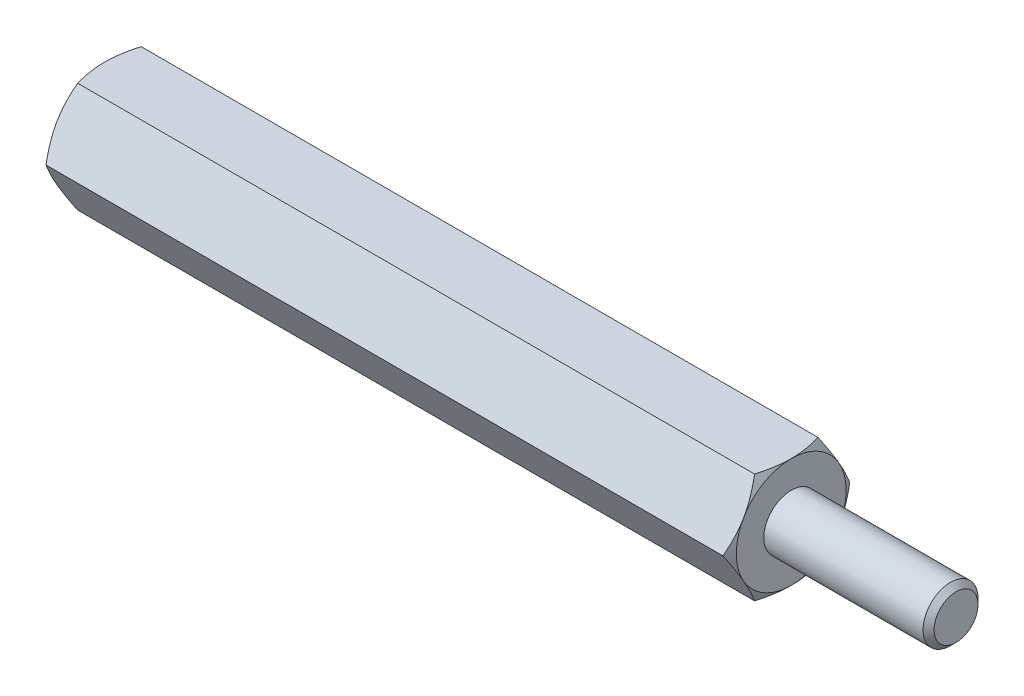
ISO-10303-21;
HEADER;
FILE_DESCRIPTION(('STEP AP214'),'2;1');
FILE_NAME('part.step','',(''),(''),'','','');
FILE_SCHEMA(('AUTOMOTIVE_DESIGN { 1 0 10303 214 1 1 1 1 }'));
ENDSEC;
DATA;
#1=APPLICATION_CONTEXT('core data for automotive mechanical design processes');
#2=APPLICATION_PROTOCOL_DEFINITION('international standard','automotive_design',2000,#1);
#3=PRODUCT_CONTEXT('',#1,'mechanical');
#4=PRODUCT('Part','Part','',(#3));
#5=PRODUCT_RELATED_PRODUCT_CATEGORY('part','',(#4));
#6=PRODUCT_DEFINITION_FORMATION('','',#4);
#7=PRODUCT_DEFINITION_CONTEXT('part definition',#1,'design');
#8=PRODUCT_DEFINITION('design','',#6,#7);
#9=PRODUCT_DEFINITION_SHAPE('','',#8);
#10=(LENGTH_UNIT() NAMED_UNIT(*) SI_UNIT(.MILLI.,.METRE.));
#11=(NAMED_UNIT(*) PLANE_ANGLE_UNIT() SI_UNIT($,.RADIAN.));
#12=(NAMED_UNIT(*) SI_UNIT($,.STERADIAN.) SOLID_ANGLE_UNIT());
#13=UNCERTAINTY_MEASURE_WITH_UNIT(LENGTH_MEASURE(1.E-05),#10,'distance_accuracy_value','');
#14=(GEOMETRIC_REPRESENTATION_CONTEXT(3) GLOBAL_UNCERTAINTY_ASSIGNED_CONTEXT((#13)) GLOBAL_UNIT_ASSIGNED_CONTEXT((#10,
#11,#12)) REPRESENTATION_CONTEXT('',''));
#15=CARTESIAN_POINT('',(0.,0.,0.));
#16=DIRECTION('',(0.,0.,1.));
#17=DIRECTION('',(1.,0.,0.));
#18=AXIS2_PLACEMENT_3D('',#15,#16,#17);
#19=CARTESIAN_POINT('',(12.5,2.,-1.15470053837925));
#20=DIRECTION('',(1.,0.,0.));
#21=DIRECTION('',(0.,0.,-1.));
#22=AXIS2_PLACEMENT_3D('',#19,#20,#21);
#23=PLANE('',#22);
#24=CARTESIAN_POINT('',(12.5,0.,0.));
#25=DIRECTION('',(1.,0.,0.));
#26=DIRECTION('',(0.,0.,-1.));
#27=AXIS2_PLACEMENT_3D('',#24,#25,#26);
#28=CIRCLE('',#27,2.);
#29=CARTESIAN_POINT('',(12.5,-1.,-1.73205080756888));
#30=VERTEX_POINT('',#29);
#31=CARTESIAN_POINT('',(12.5,0.999999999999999,-1.73205080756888));
#32=VERTEX_POINT('',#31);
#33=EDGE_CURVE('E288',#30,#32,#28,.T.);
#34=ORIENTED_EDGE('',*,*,#33,.T.);
#35=CARTESIAN_POINT('',(12.5,2.,0.));
#36=VERTEX_POINT('',#35);
#37=EDGE_CURVE('E53',#32,#36,#28,.T.);
#38=ORIENTED_EDGE('',*,*,#37,.T.);
#39=CARTESIAN_POINT('',(12.5,0.999999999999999,1.73205080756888));
#40=VERTEX_POINT('',#39);
#41=EDGE_CURVE('E297',#36,#40,#28,.T.);
#42=ORIENTED_EDGE('',*,*,#41,.T.);
#43=CARTESIAN_POINT('',(12.5,-1.,1.73205080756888));
#44=VERTEX_POINT('',#43);
#45=EDGE_CURVE('E302',#40,#44,#28,.T.);
#46=ORIENTED_EDGE('',*,*,#45,.T.);
#47=CARTESIAN_POINT('',(12.5,0.,0.));
#48=DIRECTION('',(-1.,0.,0.));
#49=DIRECTION('',(0.,-1.,0.));
#50=AXIS2_PLACEMENT_3D('',#47,#48,#49);
#51=CIRCLE('',#50,2.);
#52=CARTESIAN_POINT('',(12.5,-2.,0.));
#53=VERTEX_POINT('',#52);
#54=EDGE_CURVE('E193',#53,#44,#51,.T.);
#55=ORIENTED_EDGE('',*,*,#54,.F.);
#56=EDGE_CURVE('E61',#53,#30,#28,.T.);
#57=ORIENTED_EDGE('',*,*,#56,.T.);
#58=EDGE_LOOP('',(#34,#38,#42,#46,#55,#57));
#59=FACE_BOUND('',#58,.T.);
#60=CARTESIAN_POINT('',(12.5,0.,0.));
#61=DIRECTION('',(1.,0.,0.));
#62=DIRECTION('',(0.,0.,-1.));
#63=AXIS2_PLACEMENT_3D('',#60,#61,#62);
#64=CIRCLE('',#63,1.);
#65=CARTESIAN_POINT('',(12.5,0.,-1.));
#66=VERTEX_POINT('',#65);
#67=EDGE_CURVE('E323',#66,#66,#64,.T.);
#68=ORIENTED_EDGE('',*,*,#67,.F.);
#69=EDGE_LOOP('',(#68));
#70=FACE_BOUND('',#69,.T.);
#71=ADVANCED_FACE('F37',(#59,#70),#23,.T.);
#72=CARTESIAN_POINT('',(12.5,0.,-2.3094010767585));
#73=DIRECTION('',(0.,-0.5,0.866025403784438));
#74=DIRECTION('',(0.,-0.866025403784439,-0.5));
#75=AXIS2_PLACEMENT_3D('',#72,#73,#74);
#76=PLANE('',#75);
#77=CARTESIAN_POINT('',(12.3213005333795,-0.000200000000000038,-2.30951654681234));
#78=CARTESIAN_POINT('',(12.3506104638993,0.0876912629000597,-2.25877250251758));
#79=CARTESIAN_POINT('',(12.3772671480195,0.176341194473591,-2.20759044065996));
#80=CARTESIAN_POINT('',(12.4237975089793,0.355176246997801,-2.10433997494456));
#81=CARTESIAN_POINT('',(12.4436547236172,0.445364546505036,-2.05226973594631));
#82=CARTESIAN_POINT('',(12.4745665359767,0.624623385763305,-1.94877459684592));
#83=CARTESIAN_POINT('',(12.4858268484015,0.713666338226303,-1.89736562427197));
#84=CARTESIAN_POINT('',(12.4992713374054,0.892171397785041,-1.79430568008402));
#85=CARTESIAN_POINT('',(12.5014666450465,0.981632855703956,-1.74265508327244));
#86=CARTESIAN_POINT('',(12.4969090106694,1.1488083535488,-1.64613626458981));
#87=CARTESIAN_POINT('',(12.491275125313,1.22654737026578,-1.60125362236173));
#88=CARTESIAN_POINT('',(12.4734161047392,1.38151891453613,-1.51178075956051));
#89=CARTESIAN_POINT('',(12.4611848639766,1.4587509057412,-1.46719084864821));
#90=CARTESIAN_POINT('',(12.4306065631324,1.6140421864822,-1.37753338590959));
#91=CARTESIAN_POINT('',(12.4121298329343,1.69208181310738,-1.33247718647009));
#92=CARTESIAN_POINT('',(12.3701944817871,1.84699686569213,-1.24303693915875));
#93=CARTESIAN_POINT('',(12.3467457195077,1.92387427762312,-1.1986517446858));
#94=CARTESIAN_POINT('',(12.3213005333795,2.0002,-1.15458506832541));
#95=B_SPLINE_CURVE_WITH_KNOTS('',3,(#77,#78,#79,#80,#81,#82,#83,#84,#85,#86,#87,#88,#89,#90,#91,
#92,#93,#94),.UNSPECIFIED.,.F.,.F.,(4,2,2,2,2,2,2,2,4),(0.,0.317031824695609,0.634825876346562,
0.944753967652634,1.25430138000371,1.52387047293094,1.79368946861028,2.06949491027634,
2.34475850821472),.UNSPECIFIED.);
#96=CARTESIAN_POINT('',(12.3213672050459,0.,-2.3094010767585));
#97=VERTEX_POINT('',#96);
#98=EDGE_CURVE('E359',#97,#32,#95,.T.);
#99=ORIENTED_EDGE('',*,*,#98,.F.);
#100=DIRECTION('',(-1.,0.,0.));
#101=VECTOR('',#100,1.);
#102=CARTESIAN_POINT('',(12.5,0.,-2.3094010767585));
#103=LINE('',#102,#101);
#104=CARTESIAN_POINT('',(-12.3213672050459,0.,-2.3094010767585));
#105=VERTEX_POINT('',#104);
#106=EDGE_CURVE('E264',#97,#105,#103,.T.);
#107=ORIENTED_EDGE('',*,*,#106,.T.);
#108=CARTESIAN_POINT('',(-12.3213005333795,2.0002,-1.15458506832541));
#109=CARTESIAN_POINT('',(-12.3506104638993,1.91230873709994,-1.20532911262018));
#110=CARTESIAN_POINT('',(-12.3772671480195,1.82365880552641,-1.2565111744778));
#111=CARTESIAN_POINT('',(-12.4237975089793,1.6448237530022,-1.35976164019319));
#112=CARTESIAN_POINT('',(-12.4436547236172,1.55463545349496,-1.41183187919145));
#113=CARTESIAN_POINT('',(-12.4745665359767,1.37537661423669,-1.51532701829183));
#114=CARTESIAN_POINT('',(-12.4858268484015,1.2863336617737,-1.56673599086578));
#115=CARTESIAN_POINT('',(-12.4992713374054,1.10782860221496,-1.66979593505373));
#116=CARTESIAN_POINT('',(-12.5014666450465,1.01836714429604,-1.72144653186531));
#117=CARTESIAN_POINT('',(-12.4969090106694,0.851191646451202,-1.81796535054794));
#118=CARTESIAN_POINT('',(-12.491275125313,0.773452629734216,-1.86284799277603));
#119=CARTESIAN_POINT('',(-12.4734161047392,0.618481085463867,-1.95232085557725));
#120=CARTESIAN_POINT('',(-12.4611848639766,0.541249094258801,-1.99691076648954));
#121=CARTESIAN_POINT('',(-12.4306065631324,0.385957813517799,-2.08656822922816));
#122=CARTESIAN_POINT('',(-12.4121298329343,0.307918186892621,-2.13162442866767));
#123=CARTESIAN_POINT('',(-12.3701944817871,0.153003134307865,-2.221064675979));
#124=CARTESIAN_POINT('',(-12.3467457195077,0.07612572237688,-2.26544987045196));
#125=CARTESIAN_POINT('',(-12.3213005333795,-0.000199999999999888,-2.30951654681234));
#126=B_SPLINE_CURVE_WITH_KNOTS('',3,(#108,#109,#110,#111,#112,#113,#114,#115,#116,#117,#118,
#119,#120,#121,#122,#123,#124,#125),.UNSPECIFIED.,.F.,.F.,(4,2,2,2,2,2,2,2,4),(0.,
0.31703182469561,0.634825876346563,0.944753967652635,1.25430138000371,1.52387047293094,
1.79368946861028,2.06949491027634,2.34475850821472),.UNSPECIFIED.);
#127=CARTESIAN_POINT('',(-12.5,0.999999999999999,-1.73205080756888));
#128=VERTEX_POINT('',#127);
#129=EDGE_CURVE('E375',#128,#105,#126,.T.);
#130=ORIENTED_EDGE('',*,*,#129,.F.);
#131=CARTESIAN_POINT('',(-12.3213672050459,2.,-1.15470053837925));
#132=VERTEX_POINT('',#131);
#133=EDGE_CURVE('E374',#132,#128,#126,.T.);
#134=ORIENTED_EDGE('',*,*,#133,.F.);
#135=DIRECTION('',(-1.,0.,0.));
#136=VECTOR('',#135,1.);
#137=CARTESIAN_POINT('',(12.5,2.,-1.15470053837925));
#138=LINE('',#137,#136);
#139=CARTESIAN_POINT('',(12.321367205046,2.,-1.15470053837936));
#140=VERTEX_POINT('',#139);
#141=EDGE_CURVE('E279',#140,#132,#138,.T.);
#142=ORIENTED_EDGE('',*,*,#141,.F.);
#143=EDGE_CURVE('E229',#32,#140,#95,.T.);
#144=ORIENTED_EDGE('',*,*,#143,.F.);
#145=EDGE_LOOP('',(#99,#107,#130,#134,#142,#144));
#146=FACE_BOUND('',#145,.T.);
#147=ADVANCED_FACE('F148',(#146),#76,.F.);
#148=CARTESIAN_POINT('',(12.5,2.,-1.15470053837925));
#149=DIRECTION('',(0.,-1.,0.));
#150=DIRECTION('',(0.,0.,-1.));
#151=AXIS2_PLACEMENT_3D('',#148,#149,#150);
#152=PLANE('',#151);
#153=CARTESIAN_POINT('',(11.5041453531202,2.,-3.14239762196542));
#154=CARTESIAN_POINT('',(11.5468568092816,2.,-3.05468337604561));
#155=CARTESIAN_POINT('',(11.5891703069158,2.,-2.96677207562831));
#156=CARTESIAN_POINT('',(11.6727783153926,2.,-2.79045070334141));
#157=CARTESIAN_POINT('',(11.7140726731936,2.,-2.70204055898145));
#158=CARTESIAN_POINT('',(11.7956183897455,2.,-2.52418069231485));
#159=CARTESIAN_POINT('',(11.8358631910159,2.,-2.43472795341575));
#160=CARTESIAN_POINT('',(11.9147590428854,2.,-2.25512498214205));
#161=CARTESIAN_POINT('',(11.9534101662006,2.,-2.16497478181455));
#162=CARTESIAN_POINT('',(12.0299661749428,2.,-1.98078525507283));
#163=CARTESIAN_POINT('',(12.0678021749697,2.,-1.88671714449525));
#164=CARTESIAN_POINT('',(12.1407004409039,2.,-1.69751412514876));
#165=CARTESIAN_POINT('',(12.1757629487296,2.,-1.60237931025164));
#166=CARTESIAN_POINT('',(12.2422353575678,2.,-1.41102905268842));
#167=CARTESIAN_POINT('',(12.2736519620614,2.,-1.31481596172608));
#168=CARTESIAN_POINT('',(12.3318476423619,2.,-1.12101028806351));
#169=CARTESIAN_POINT('',(12.3586281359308,2.,-1.02341813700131));
#170=CARTESIAN_POINT('',(12.4061516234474,2.,-0.827336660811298));
#171=CARTESIAN_POINT('',(12.4269281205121,2.,-0.728855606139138));
#172=CARTESIAN_POINT('',(12.4612955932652,2.,-0.530628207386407));
#173=CARTESIAN_POINT('',(12.4748873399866,2.,-0.430882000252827));
#174=CARTESIAN_POINT('',(12.4936215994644,2.,-0.231937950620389));
#175=CARTESIAN_POINT('',(12.498875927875,2.,-0.132750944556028));
#176=CARTESIAN_POINT('',(12.5007996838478,2.,0.0657049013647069));
#177=CARTESIAN_POINT('',(12.4974689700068,2.,0.164973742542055));
#178=CARTESIAN_POINT('',(12.4796512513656,2.,0.400692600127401));
#179=CARTESIAN_POINT('',(12.4613884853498,2.,0.53685971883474));
#180=CARTESIAN_POINT('',(12.4117995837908,2.,0.806792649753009));
#181=CARTESIAN_POINT('',(12.3804615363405,2.,0.940556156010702));
#182=CARTESIAN_POINT('',(12.3073369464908,2.,1.20849227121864));
#183=CARTESIAN_POINT('',(12.2653231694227,2.,1.34260127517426));
#184=CARTESIAN_POINT('',(12.1970115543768,2.,1.54188460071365));
#185=CARTESIAN_POINT('',(12.1733612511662,2.,1.6079939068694));
#186=CARTESIAN_POINT('',(12.1245731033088,2.,1.73966131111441));
#187=CARTESIAN_POINT('',(12.0994352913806,2.,1.80521942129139));
#188=CARTESIAN_POINT('',(12.0304524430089,2.,1.98014362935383));
#189=CARTESIAN_POINT('',(11.9854828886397,2.,2.08906517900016));
#190=CARTESIAN_POINT('',(11.8929395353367,2.,2.3058004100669));
#191=CARTESIAN_POINT('',(11.845365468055,2.,2.41361397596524));
#192=CARTESIAN_POINT('',(11.7482262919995,2.,2.62838132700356));
#193=CARTESIAN_POINT('',(11.6986605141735,2.,2.7353348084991));
#194=CARTESIAN_POINT('',(11.5980014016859,2.,2.94852186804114));
#195=CARTESIAN_POINT('',(11.546908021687,2.,3.05475542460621));
#196=CARTESIAN_POINT('',(11.3916961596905,2.,3.37291303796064));
#197=CARTESIAN_POINT('',(11.2857965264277,2.,3.58396705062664));
#198=CARTESIAN_POINT('',(11.0710098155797,2.,4.00448363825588));
#199=CARTESIAN_POINT('',(10.9621233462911,2.,4.21394652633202));
#200=CARTESIAN_POINT('',(10.7537677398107,2.,4.61000648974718));
#201=CARTESIAN_POINT('',(10.6545007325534,2.,4.79671008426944));
#202=CARTESIAN_POINT('',(10.4547641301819,2.,5.16948614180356));
#203=CARTESIAN_POINT('',(10.3542944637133,2.,5.35555856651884));
#204=CARTESIAN_POINT('',(10.1527937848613,2.,5.72660635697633));
#205=CARTESIAN_POINT('',(10.0517657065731,2.,5.91158331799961));
#206=CARTESIAN_POINT('',(9.84902395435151,2.,6.28114276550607));
#207=CARTESIAN_POINT('',(9.74731033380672,2.,6.46572528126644));
#208=CARTESIAN_POINT('',(9.64534707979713,2.,6.65016883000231));
#209=B_SPLINE_CURVE_WITH_KNOTS('',3,(#153,#154,#155,#156,#157,#158,#159,#160,#161,#162,#163,
#164,#165,#166,#167,#168,#169,#170,#171,#172,#173,#174,#175,#176,#177,#178,#179,#180,#181,#182,
#183,#184,#185,#186,#187,#188,#189,#190,#191,#192,#193,#194,#195,#196,#197,#198,#199,#200,#201,
#202,#203,#204,#205,#206,#207,#208),.UNSPECIFIED.,.F.,.F.,(4,2,2,2,2,2,2,2,2,2,2,2,2,2,2,2,2,2,
2,2,2,2,2,2,2,2,2,4),(0.,0.292684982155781,0.585413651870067,0.879667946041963,1.17390879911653,
1.47805164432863,1.78216793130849,2.08571589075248,2.38917085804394,2.690898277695,
2.99259331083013,3.29020694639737,3.58782548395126,3.99913738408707,4.41082482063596,
4.8321411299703,5.0427662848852,5.25338680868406,5.6068563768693,5.96036243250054,
6.31398824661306,6.66762456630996,7.37597688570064,8.08418599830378,8.71853756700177,
9.35292696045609,9.98522933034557,10.6174830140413),.UNSPECIFIED.);
#210=EDGE_CURVE('E227',#140,#36,#209,.T.);
#211=ORIENTED_EDGE('',*,*,#210,.F.);
#212=ORIENTED_EDGE('',*,*,#141,.T.);
#213=CARTESIAN_POINT('',(-11.5041453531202,2.,-3.14239762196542));
#214=CARTESIAN_POINT('',(-11.5468568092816,2.,-3.05468337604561));
#215=CARTESIAN_POINT('',(-11.5891703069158,2.,-2.96677207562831));
#216=CARTESIAN_POINT('',(-11.6727783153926,2.,-2.79045070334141));
#217=CARTESIAN_POINT('',(-11.7140726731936,2.,-2.70204055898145));
#218=CARTESIAN_POINT('',(-11.7956183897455,2.,-2.52418069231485));
#219=CARTESIAN_POINT('',(-11.8358631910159,2.,-2.43472795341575));
#220=CARTESIAN_POINT('',(-11.9147590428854,2.,-2.25512498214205));
#221=CARTESIAN_POINT('',(-11.9534101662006,2.,-2.16497478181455));
#222=CARTESIAN_POINT('',(-12.0299661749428,2.,-1.98078525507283));
#223=CARTESIAN_POINT('',(-12.0678021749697,2.,-1.88671714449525));
#224=CARTESIAN_POINT('',(-12.1407004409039,2.,-1.69751412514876));
#225=CARTESIAN_POINT('',(-12.1757629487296,2.,-1.60237931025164));
#226=CARTESIAN_POINT('',(-12.2422353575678,2.,-1.41102905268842));
#227=CARTESIAN_POINT('',(-12.2736519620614,2.,-1.31481596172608));
#228=CARTESIAN_POINT('',(-12.3318476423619,2.,-1.12101028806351));
#229=CARTESIAN_POINT('',(-12.3586281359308,2.,-1.02341813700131));
#230=CARTESIAN_POINT('',(-12.4061516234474,2.,-0.827336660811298));
#231=CARTESIAN_POINT('',(-12.4269281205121,2.,-0.728855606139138));
#232=CARTESIAN_POINT('',(-12.4612955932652,2.,-0.530628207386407));
#233=CARTESIAN_POINT('',(-12.4748873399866,2.,-0.430882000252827));
#234=CARTESIAN_POINT('',(-12.4936215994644,2.,-0.231937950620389));
#235=CARTESIAN_POINT('',(-12.498875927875,2.,-0.132750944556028));
#236=CARTESIAN_POINT('',(-12.5007996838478,2.,0.0657049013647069));
#237=CARTESIAN_POINT('',(-12.4974689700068,2.,0.164973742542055));
#238=CARTESIAN_POINT('',(-12.4796512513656,2.,0.400692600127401));
#239=CARTESIAN_POINT('',(-12.4613884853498,2.,0.53685971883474));
#240=CARTESIAN_POINT('',(-12.4117995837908,2.,0.806792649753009));
#241=CARTESIAN_POINT('',(-12.3804615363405,2.,0.940556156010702));
#242=CARTESIAN_POINT('',(-12.3073369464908,2.,1.20849227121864));
#243=CARTESIAN_POINT('',(-12.2653231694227,2.,1.34260127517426));
#244=CARTESIAN_POINT('',(-12.1970115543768,2.,1.54188460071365));
#245=CARTESIAN_POINT('',(-12.1733612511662,2.,1.6079939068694));
#246=CARTESIAN_POINT('',(-12.1245731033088,2.,1.73966131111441));
#247=CARTESIAN_POINT('',(-12.0994352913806,2.,1.80521942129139));
#248=CARTESIAN_POINT('',(-12.030452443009,2.,1.98014362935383));
#249=CARTESIAN_POINT('',(-11.9854828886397,2.,2.08906517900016));
#250=CARTESIAN_POINT('',(-11.8929395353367,2.,2.3058004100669));
#251=CARTESIAN_POINT('',(-11.845365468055,2.,2.41361397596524));
#252=CARTESIAN_POINT('',(-11.7482262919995,2.,2.62838132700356));
#253=CARTESIAN_POINT('',(-11.6986605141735,2.,2.7353348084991));
#254=CARTESIAN_POINT('',(-11.5980014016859,2.,2.94852186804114));
#255=CARTESIAN_POINT('',(-11.546908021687,2.,3.05475542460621));
#256=CARTESIAN_POINT('',(-11.3916961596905,2.,3.37291303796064));
#257=CARTESIAN_POINT('',(-11.2857965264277,2.,3.58396705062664));
#258=CARTESIAN_POINT('',(-11.0710098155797,2.,4.00448363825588));
#259=CARTESIAN_POINT('',(-10.9621233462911,2.,4.21394652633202));
#260=CARTESIAN_POINT('',(-10.7537677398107,2.,4.61000648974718));
#261=CARTESIAN_POINT('',(-10.6545007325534,2.,4.79671008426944));
#262=CARTESIAN_POINT('',(-10.4547641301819,2.,5.16948614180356));
#263=CARTESIAN_POINT('',(-10.3542944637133,2.,5.35555856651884));
#264=CARTESIAN_POINT('',(-10.1527937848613,2.,5.72660635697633));
#265=CARTESIAN_POINT('',(-10.0517657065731,2.,5.9115833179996));
#266=CARTESIAN_POINT('',(-9.84902395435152,2.,6.28114276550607));
#267=CARTESIAN_POINT('',(-9.74731033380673,2.,6.46572528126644));
#268=CARTESIAN_POINT('',(-9.64534707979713,2.,6.65016883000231));
#269=B_SPLINE_CURVE_WITH_KNOTS('',3,(#213,#214,#215,#216,#217,#218,#219,#220,#221,#222,#223,
#224,#225,#226,#227,#228,#229,#230,#231,#232,#233,#234,#235,#236,#237,#238,#239,#240,#241,#242,
#243,#244,#245,#246,#247,#248,#249,#250,#251,#252,#253,#254,#255,#256,#257,#258,#259,#260,#261,
#262,#263,#264,#265,#266,#267,#268),.UNSPECIFIED.,.F.,.F.,(4,2,2,2,2,2,2,2,2,2,2,2,2,2,2,2,2,2,
2,2,2,2,2,2,2,2,2,4),(0.,0.292684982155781,0.585413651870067,0.879667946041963,1.17390879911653,
1.47805164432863,1.78216793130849,2.08571589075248,2.38917085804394,2.690898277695,
2.99259331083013,3.29020694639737,3.58782548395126,3.99913738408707,4.41082482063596,
4.8321411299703,5.0427662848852,5.25338680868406,5.6068563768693,5.96036243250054,
6.31398824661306,6.66762456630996,7.37597688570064,8.08418599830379,8.71853756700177,
9.3529269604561,9.98522933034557,10.6174830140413),.UNSPECIFIED.);
#270=CARTESIAN_POINT('',(-12.5,2.,0.));
#271=VERTEX_POINT('',#270);
#272=EDGE_CURVE('E241',#271,#132,#269,.F.);
#273=ORIENTED_EDGE('',*,*,#272,.F.);
#274=CARTESIAN_POINT('',(-12.3213672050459,2.,1.15470053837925));
#275=VERTEX_POINT('',#274);
#276=EDGE_CURVE('E249',#275,#271,#269,.F.);
#277=ORIENTED_EDGE('',*,*,#276,.F.);
#278=DIRECTION('',(-1.,0.,0.));
#279=VECTOR('',#278,1.);
#280=CARTESIAN_POINT('',(12.5,2.,1.15470053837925));
#281=LINE('',#280,#279);
#282=CARTESIAN_POINT('',(12.3213672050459,2.,1.15470053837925));
#283=VERTEX_POINT('',#282);
#284=EDGE_CURVE('E276',#283,#275,#281,.T.);
#285=ORIENTED_EDGE('',*,*,#284,.F.);
#286=EDGE_CURVE('E221',#36,#283,#209,.T.);
#287=ORIENTED_EDGE('',*,*,#286,.F.);
#288=EDGE_LOOP('',(#211,#212,#273,#277,#285,#287));
#289=FACE_BOUND('',#288,.T.);
#290=ADVANCED_FACE('F153',(#289),#152,.F.);
#291=CARTESIAN_POINT('',(12.5,2.,1.15470053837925));
#292=DIRECTION('',(0.,-0.5,-0.866025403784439));
#293=DIRECTION('',(0.,0.866025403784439,-0.5));
#294=AXIS2_PLACEMENT_3D('',#291,#292,#293);
#295=PLANE('',#294);
#296=CARTESIAN_POINT('',(12.3213005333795,2.0002,1.15458506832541));
#297=CARTESIAN_POINT('',(12.3506104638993,1.91230873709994,1.20532911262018));
#298=CARTESIAN_POINT('',(12.3772671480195,1.82365880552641,1.2565111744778));
#299=CARTESIAN_POINT('',(12.4237975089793,1.6448237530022,1.35976164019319));
#300=CARTESIAN_POINT('',(12.4436547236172,1.55463545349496,1.41183187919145));
#301=CARTESIAN_POINT('',(12.4745665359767,1.37537661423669,1.51532701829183));
#302=CARTESIAN_POINT('',(12.4858268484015,1.2863336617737,1.56673599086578));
#303=CARTESIAN_POINT('',(12.4992713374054,1.10782860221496,1.66979593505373));
#304=CARTESIAN_POINT('',(12.5014666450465,1.01836714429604,1.72144653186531));
#305=CARTESIAN_POINT('',(12.4969090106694,0.851191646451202,1.81796535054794));
#306=CARTESIAN_POINT('',(12.491275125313,0.773452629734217,1.86284799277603));
#307=CARTESIAN_POINT('',(12.4734161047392,0.618481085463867,1.95232085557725));
#308=CARTESIAN_POINT('',(12.4611848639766,0.541249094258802,1.99691076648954));
#309=CARTESIAN_POINT('',(12.4306065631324,0.3859578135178,2.08656822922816));
#310=CARTESIAN_POINT('',(12.4121298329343,0.307918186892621,2.13162442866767));
#311=CARTESIAN_POINT('',(12.3701944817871,0.153003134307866,2.221064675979));
#312=CARTESIAN_POINT('',(12.3467457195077,0.0761257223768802,2.26544987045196));
#313=CARTESIAN_POINT('',(12.3213005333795,-0.000199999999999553,2.30951654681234));
#314=B_SPLINE_CURVE_WITH_KNOTS('',3,(#296,#297,#298,#299,#300,#301,#302,#303,#304,#305,#306,
#307,#308,#309,#310,#311,#312,#313),.UNSPECIFIED.,.F.,.F.,(4,2,2,2,2,2,2,2,4),(0.,
0.317031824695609,0.634825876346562,0.944753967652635,1.25430138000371,1.52387047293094,
1.79368946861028,2.06949491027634,2.34475850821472),.UNSPECIFIED.);
#315=EDGE_CURVE('E228',#283,#40,#314,.T.);
#316=ORIENTED_EDGE('',*,*,#315,.F.);
#317=ORIENTED_EDGE('',*,*,#284,.T.);
#318=CARTESIAN_POINT('',(-12.3213005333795,-0.000199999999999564,2.30951654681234));
#319=CARTESIAN_POINT('',(-12.3506104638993,0.0876912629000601,2.25877250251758));
#320=CARTESIAN_POINT('',(-12.3772671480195,0.176341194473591,2.20759044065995));
#321=CARTESIAN_POINT('',(-12.4237975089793,0.355176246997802,2.10433997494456));
#322=CARTESIAN_POINT('',(-12.4436547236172,0.445364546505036,2.0522697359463));
#323=CARTESIAN_POINT('',(-12.4745665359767,0.624623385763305,1.94877459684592));
#324=CARTESIAN_POINT('',(-12.4858268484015,0.713666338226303,1.89736562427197));
#325=CARTESIAN_POINT('',(-12.4992713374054,0.892171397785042,1.79430568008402));
#326=CARTESIAN_POINT('',(-12.5014666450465,0.981632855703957,1.74265508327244));
#327=CARTESIAN_POINT('',(-12.4969090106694,1.1488083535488,1.64613626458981));
#328=CARTESIAN_POINT('',(-12.491275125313,1.22654737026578,1.60125362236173));
#329=CARTESIAN_POINT('',(-12.4734161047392,1.38151891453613,1.51178075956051));
#330=CARTESIAN_POINT('',(-12.4611848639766,1.4587509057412,1.46719084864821));
#331=CARTESIAN_POINT('',(-12.4306065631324,1.6140421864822,1.37753338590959));
#332=CARTESIAN_POINT('',(-12.4121298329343,1.69208181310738,1.33247718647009));
#333=CARTESIAN_POINT('',(-12.3701944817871,1.84699686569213,1.24303693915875));
#334=CARTESIAN_POINT('',(-12.3467457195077,1.92387427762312,1.1986517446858));
#335=CARTESIAN_POINT('',(-12.3213005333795,2.0002,1.15458506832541));
#336=B_SPLINE_CURVE_WITH_KNOTS('',3,(#318,#319,#320,#321,#322,#323,#324,#325,#326,#327,#328,
#329,#330,#331,#332,#333,#334,#335),.UNSPECIFIED.,.F.,.F.,(4,2,2,2,2,2,2,2,4),(0.,
0.317031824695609,0.634825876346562,0.944753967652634,1.25430138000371,1.52387047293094,
1.79368946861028,2.06949491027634,2.34475850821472),.UNSPECIFIED.);
#337=CARTESIAN_POINT('',(-12.5,0.999999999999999,1.73205080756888));
#338=VERTEX_POINT('',#337);
#339=EDGE_CURVE('E255',#338,#275,#336,.T.);
#340=ORIENTED_EDGE('',*,*,#339,.F.);
#341=CARTESIAN_POINT('',(-12.3213672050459,0.,2.3094010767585));
#342=VERTEX_POINT('',#341);
#343=EDGE_CURVE('E262',#342,#338,#336,.T.);
#344=ORIENTED_EDGE('',*,*,#343,.F.);
#345=DIRECTION('',(-1.,0.,0.));
#346=VECTOR('',#345,1.);
#347=CARTESIAN_POINT('',(12.5,0.,2.3094010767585));
#348=LINE('',#347,#346);
#349=CARTESIAN_POINT('',(12.3213672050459,0.,2.3094010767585));
#350=VERTEX_POINT('',#349);
#351=EDGE_CURVE('E273',#350,#342,#348,.T.);
#352=ORIENTED_EDGE('',*,*,#351,.F.);
#353=EDGE_CURVE('E215',#40,#350,#314,.T.);
#354=ORIENTED_EDGE('',*,*,#353,.F.);
#355=EDGE_LOOP('',(#316,#317,#340,#344,#352,#354));
#356=FACE_BOUND('',#355,.T.);
#357=ADVANCED_FACE('F235',(#356),#295,.F.);
#358=CARTESIAN_POINT('',(12.5,0.,2.3094010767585));
#359=DIRECTION('',(0.,0.5,-0.866025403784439));
#360=DIRECTION('',(0.,0.866025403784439,0.5));
#361=AXIS2_PLACEMENT_3D('',#358,#359,#360);
#362=PLANE('',#361);
#363=CARTESIAN_POINT('',(12.3213005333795,0.000200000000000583,2.30951654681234));
#364=CARTESIAN_POINT('',(12.3506104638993,-0.0876912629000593,2.25877250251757));
#365=CARTESIAN_POINT('',(12.3772671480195,-0.17634119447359,2.20759044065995));
#366=CARTESIAN_POINT('',(12.4237975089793,-0.355176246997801,2.10433997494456));
#367=CARTESIAN_POINT('',(12.4436547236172,-0.445364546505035,2.0522697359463));
#368=CARTESIAN_POINT('',(12.4745665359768,-0.624623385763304,1.94877459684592));
#369=CARTESIAN_POINT('',(12.4858268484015,-0.713666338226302,1.89736562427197));
#370=CARTESIAN_POINT('',(12.4992713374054,-0.892171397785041,1.79430568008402));
#371=CARTESIAN_POINT('',(12.5014666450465,-0.981632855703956,1.74265508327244));
#372=CARTESIAN_POINT('',(12.4969090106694,-1.1488083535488,1.64613626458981));
#373=CARTESIAN_POINT('',(12.491275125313,-1.22654737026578,1.60125362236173));
#374=CARTESIAN_POINT('',(12.4734161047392,-1.38151891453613,1.51178075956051));
#375=CARTESIAN_POINT('',(12.4611848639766,-1.4587509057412,1.46719084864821));
#376=CARTESIAN_POINT('',(12.4306065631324,-1.6140421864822,1.37753338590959));
#377=CARTESIAN_POINT('',(12.4121298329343,-1.69208181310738,1.33247718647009));
#378=CARTESIAN_POINT('',(12.3701944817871,-1.84699686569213,1.24303693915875));
#379=CARTESIAN_POINT('',(12.3467457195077,-1.92387427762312,1.1986517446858));
#380=CARTESIAN_POINT('',(12.3213005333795,-2.0002,1.15458506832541));
#381=B_SPLINE_CURVE_WITH_KNOTS('',3,(#363,#364,#365,#366,#367,#368,#369,#370,#371,#372,#373,
#374,#375,#376,#377,#378,#379,#380),.UNSPECIFIED.,.F.,.F.,(4,2,2,2,2,2,2,2,4),(0.,
0.317031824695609,0.634825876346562,0.944753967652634,1.25430138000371,1.52387047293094,
1.79368946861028,2.06949491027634,2.34475850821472),.UNSPECIFIED.);
#382=EDGE_CURVE('E327',#350,#44,#381,.T.);
#383=ORIENTED_EDGE('',*,*,#382,.F.);
#384=ORIENTED_EDGE('',*,*,#351,.T.);
#385=CARTESIAN_POINT('',(-12.3213005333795,-2.0002,1.15458506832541));
#386=CARTESIAN_POINT('',(-12.3506104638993,-1.91230873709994,1.20532911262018));
#387=CARTESIAN_POINT('',(-12.3772671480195,-1.82365880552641,1.2565111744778));
#388=CARTESIAN_POINT('',(-12.4237975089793,-1.6448237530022,1.35976164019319));
#389=CARTESIAN_POINT('',(-12.4436547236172,-1.55463545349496,1.41183187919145));
#390=CARTESIAN_POINT('',(-12.4745665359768,-1.3753766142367,1.51532701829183));
#391=CARTESIAN_POINT('',(-12.4858268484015,-1.2863336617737,1.56673599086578));
#392=CARTESIAN_POINT('',(-12.4992713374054,-1.10782860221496,1.66979593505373));
#393=CARTESIAN_POINT('',(-12.5014666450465,-1.01836714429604,1.72144653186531));
#394=CARTESIAN_POINT('',(-12.4969090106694,-0.851191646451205,1.81796535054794));
#395=CARTESIAN_POINT('',(-12.491275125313,-0.773452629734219,1.86284799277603));
#396=CARTESIAN_POINT('',(-12.4734161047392,-0.618481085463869,1.95232085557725));
#397=CARTESIAN_POINT('',(-12.4611848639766,-0.541249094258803,1.99691076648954));
#398=CARTESIAN_POINT('',(-12.4306065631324,-0.3859578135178,2.08656822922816));
#399=CARTESIAN_POINT('',(-12.4121298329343,-0.307918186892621,2.13162442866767));
#400=CARTESIAN_POINT('',(-12.3701944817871,-0.153003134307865,2.221064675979));
#401=CARTESIAN_POINT('',(-12.3467457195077,-0.0761257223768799,2.26544987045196));
#402=CARTESIAN_POINT('',(-12.3213005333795,0.000200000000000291,2.30951654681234));
#403=B_SPLINE_CURVE_WITH_KNOTS('',3,(#385,#386,#387,#388,#389,#390,#391,#392,#393,#394,#395,
#396,#397,#398,#399,#400,#401,#402),.UNSPECIFIED.,.F.,.F.,(4,2,2,2,2,2,2,2,4),(0.,
0.317031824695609,0.634825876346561,0.944753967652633,1.25430138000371,1.52387047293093,
1.79368946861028,2.06949491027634,2.34475850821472),.UNSPECIFIED.);
#404=CARTESIAN_POINT('',(-12.5,-1.,1.73205080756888));
#405=VERTEX_POINT('',#404);
#406=EDGE_CURVE('E263',#405,#342,#403,.T.);
#407=ORIENTED_EDGE('',*,*,#406,.F.);
#408=CARTESIAN_POINT('',(-12.3213672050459,-2.,1.15470053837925));
#409=VERTEX_POINT('',#408);
#410=EDGE_CURVE('E250',#409,#405,#403,.T.);
#411=ORIENTED_EDGE('',*,*,#410,.F.);
#412=DIRECTION('',(-1.,0.,0.));
#413=VECTOR('',#412,1.);
#414=CARTESIAN_POINT('',(12.5,-2.,1.15470053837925));
#415=LINE('',#414,#413);
#416=CARTESIAN_POINT('',(12.3213672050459,-2.,1.15470053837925));
#417=VERTEX_POINT('',#416);
#418=EDGE_CURVE('E270',#417,#409,#415,.T.);
#419=ORIENTED_EDGE('',*,*,#418,.F.);
#420=EDGE_CURVE('E210',#44,#417,#381,.T.);
#421=ORIENTED_EDGE('',*,*,#420,.F.);
#422=EDGE_LOOP('',(#383,#384,#407,#411,#419,#421));
#423=FACE_BOUND('',#422,.T.);
#424=ADVANCED_FACE('F405',(#423),#362,.F.);
#425=CARTESIAN_POINT('',(12.5,-2.,1.15470053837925));
#426=DIRECTION('',(0.,1.,0.));
#427=DIRECTION('',(0.,0.,1.));
#428=AXIS2_PLACEMENT_3D('',#425,#426,#427);
#429=PLANE('',#428);
#430=CARTESIAN_POINT('',(11.5041453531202,-2.,-3.14239762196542));
#431=CARTESIAN_POINT('',(11.5468568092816,-2.,-3.05468337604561));
#432=CARTESIAN_POINT('',(11.5891703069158,-2.,-2.96677207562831));
#433=CARTESIAN_POINT('',(11.6727783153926,-2.,-2.79045070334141));
#434=CARTESIAN_POINT('',(11.7140726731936,-2.,-2.70204055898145));
#435=CARTESIAN_POINT('',(11.7956183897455,-2.,-2.52418069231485));
#436=CARTESIAN_POINT('',(11.8358631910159,-2.,-2.43472795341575));
#437=CARTESIAN_POINT('',(11.9147590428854,-2.,-2.25512498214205));
#438=CARTESIAN_POINT('',(11.9534101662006,-2.,-2.16497478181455));
#439=CARTESIAN_POINT('',(12.0299661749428,-2.,-1.98078525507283));
#440=CARTESIAN_POINT('',(12.0678021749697,-2.,-1.88671714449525));
#441=CARTESIAN_POINT('',(12.1407004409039,-2.,-1.69751412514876));
#442=CARTESIAN_POINT('',(12.1757629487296,-2.,-1.60237931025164));
#443=CARTESIAN_POINT('',(12.2422353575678,-2.,-1.41102905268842));
#444=CARTESIAN_POINT('',(12.2736519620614,-2.,-1.31481596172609));
#445=CARTESIAN_POINT('',(12.3318476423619,-2.,-1.12101028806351));
#446=CARTESIAN_POINT('',(12.3586281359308,-2.,-1.02341813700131));
#447=CARTESIAN_POINT('',(12.4061516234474,-2.,-0.827336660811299));
#448=CARTESIAN_POINT('',(12.4269281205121,-2.,-0.72885560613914));
#449=CARTESIAN_POINT('',(12.4612955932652,-2.,-0.530628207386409));
#450=CARTESIAN_POINT('',(12.4748873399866,-2.,-0.430882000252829));
#451=CARTESIAN_POINT('',(12.4936215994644,-2.,-0.23193795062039));
#452=CARTESIAN_POINT('',(12.498875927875,-2.,-0.13275094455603));
#453=CARTESIAN_POINT('',(12.5007996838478,-2.,0.0657049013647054));
#454=CARTESIAN_POINT('',(12.4974689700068,-2.,0.164973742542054));
#455=CARTESIAN_POINT('',(12.4796512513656,-2.,0.400692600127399));
#456=CARTESIAN_POINT('',(12.4613884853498,-2.,0.536859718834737));
#457=CARTESIAN_POINT('',(12.4117995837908,-2.,0.806792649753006));
#458=CARTESIAN_POINT('',(12.3804615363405,-2.,0.940556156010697));
#459=CARTESIAN_POINT('',(12.3073369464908,-2.,1.20849227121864));
#460=CARTESIAN_POINT('',(12.2653231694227,-2.,1.34260127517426));
#461=CARTESIAN_POINT('',(12.1970115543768,-2.,1.54188460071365));
#462=CARTESIAN_POINT('',(12.1733612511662,-2.,1.60799390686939));
#463=CARTESIAN_POINT('',(12.1245731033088,-2.,1.7396613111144));
#464=CARTESIAN_POINT('',(12.0994352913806,-2.,1.80521942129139));
#465=CARTESIAN_POINT('',(12.030452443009,-2.,1.98014362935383));
#466=CARTESIAN_POINT('',(11.9854828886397,-2.,2.08906517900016));
#467=CARTESIAN_POINT('',(11.8929395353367,-2.,2.3058004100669));
#468=CARTESIAN_POINT('',(11.845365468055,-2.,2.41361397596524));
#469=CARTESIAN_POINT('',(11.7482262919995,-2.,2.62838132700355));
#470=CARTESIAN_POINT('',(11.6986605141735,-2.,2.7353348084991));
#471=CARTESIAN_POINT('',(11.5980014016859,-2.,2.94852186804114));
#472=CARTESIAN_POINT('',(11.546908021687,-2.,3.05475542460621));
#473=CARTESIAN_POINT('',(11.3916961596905,-2.,3.37291303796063));
#474=CARTESIAN_POINT('',(11.2857965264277,-2.,3.58396705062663));
#475=CARTESIAN_POINT('',(11.0710098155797,-2.,4.00448363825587));
#476=CARTESIAN_POINT('',(10.9621233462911,-2.,4.21394652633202));
#477=CARTESIAN_POINT('',(10.7537677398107,-2.,4.61000648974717));
#478=CARTESIAN_POINT('',(10.6545007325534,-2.,4.79671008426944));
#479=CARTESIAN_POINT('',(10.4547641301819,-2.,5.16948614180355));
#480=CARTESIAN_POINT('',(10.3542944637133,-2.,5.35555856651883));
#481=CARTESIAN_POINT('',(10.1527937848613,-2.,5.72660635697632));
#482=CARTESIAN_POINT('',(10.0517657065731,-2.,5.9115833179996));
#483=CARTESIAN_POINT('',(9.84902395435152,-2.,6.28114276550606));
#484=CARTESIAN_POINT('',(9.74731033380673,-2.,6.46572528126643));
#485=CARTESIAN_POINT('',(9.64534707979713,-2.,6.6501688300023));
#486=B_SPLINE_CURVE_WITH_KNOTS('',3,(#430,#431,#432,#433,#434,#435,#436,#437,#438,#439,#440,
#441,#442,#443,#444,#445,#446,#447,#448,#449,#450,#451,#452,#453,#454,#455,#456,#457,#458,#459,
#460,#461,#462,#463,#464,#465,#466,#467,#468,#469,#470,#471,#472,#473,#474,#475,#476,#477,#478,
#479,#480,#481,#482,#483,#484,#485),.UNSPECIFIED.,.F.,.F.,(4,2,2,2,2,2,2,2,2,2,2,2,2,2,2,2,2,2,
2,2,2,2,2,2,2,2,2,4),(0.,0.292684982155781,0.585413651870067,0.879667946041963,1.17390879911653,
1.47805164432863,1.78216793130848,2.08571589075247,2.38917085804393,2.69089827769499,
2.99259331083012,3.29020694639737,3.58782548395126,3.99913738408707,4.41082482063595,
4.83214112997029,5.04276628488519,5.25338680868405,5.60685637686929,5.96036243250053,
6.31398824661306,6.66762456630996,7.37597688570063,8.08418599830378,8.71853756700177,
9.35292696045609,9.98522933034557,10.6174830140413),.UNSPECIFIED.);
#487=EDGE_CURVE('E344',#417,#53,#486,.F.);
#488=ORIENTED_EDGE('',*,*,#487,.F.);
#489=ORIENTED_EDGE('',*,*,#418,.T.);
#490=CARTESIAN_POINT('',(-11.5041453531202,-2.,-3.14239762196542));
#491=CARTESIAN_POINT('',(-11.5468568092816,-2.,-3.05468337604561));
#492=CARTESIAN_POINT('',(-11.5891703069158,-2.,-2.96677207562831));
#493=CARTESIAN_POINT('',(-11.6727783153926,-2.,-2.79045070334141));
#494=CARTESIAN_POINT('',(-11.7140726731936,-2.,-2.70204055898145));
#495=CARTESIAN_POINT('',(-11.7956183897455,-2.,-2.52418069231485));
#496=CARTESIAN_POINT('',(-11.8358631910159,-2.,-2.43472795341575));
#497=CARTESIAN_POINT('',(-11.9147590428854,-2.,-2.25512498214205));
#498=CARTESIAN_POINT('',(-11.9534101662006,-2.,-2.16497478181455));
#499=CARTESIAN_POINT('',(-12.0299661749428,-2.,-1.98078525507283));
#500=CARTESIAN_POINT('',(-12.0678021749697,-2.,-1.88671714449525));
#501=CARTESIAN_POINT('',(-12.1407004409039,-2.,-1.69751412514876));
#502=CARTESIAN_POINT('',(-12.1757629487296,-2.,-1.60237931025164));
#503=CARTESIAN_POINT('',(-12.2422353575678,-2.,-1.41102905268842));
#504=CARTESIAN_POINT('',(-12.2736519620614,-2.,-1.31481596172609));
#505=CARTESIAN_POINT('',(-12.3318476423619,-2.,-1.12101028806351));
#506=CARTESIAN_POINT('',(-12.3586281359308,-2.,-1.02341813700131));
#507=CARTESIAN_POINT('',(-12.4061516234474,-2.,-0.827336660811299));
#508=CARTESIAN_POINT('',(-12.4269281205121,-2.,-0.72885560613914));
#509=CARTESIAN_POINT('',(-12.4612955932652,-2.,-0.530628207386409));
#510=CARTESIAN_POINT('',(-12.4748873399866,-2.,-0.430882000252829));
#511=CARTESIAN_POINT('',(-12.4936215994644,-2.,-0.23193795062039));
#512=CARTESIAN_POINT('',(-12.498875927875,-2.,-0.13275094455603));
#513=CARTESIAN_POINT('',(-12.5007996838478,-2.,0.0657049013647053));
#514=CARTESIAN_POINT('',(-12.4974689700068,-2.,0.164973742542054));
#515=CARTESIAN_POINT('',(-12.4796512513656,-2.,0.400692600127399));
#516=CARTESIAN_POINT('',(-12.4613884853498,-2.,0.536859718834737));
#517=CARTESIAN_POINT('',(-12.4117995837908,-2.,0.806792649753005));
#518=CARTESIAN_POINT('',(-12.3804615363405,-2.,0.940556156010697));
#519=CARTESIAN_POINT('',(-12.3073369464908,-2.,1.20849227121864));
#520=CARTESIAN_POINT('',(-12.2653231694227,-2.,1.34260127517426));
#521=CARTESIAN_POINT('',(-12.1970115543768,-2.,1.54188460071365));
#522=CARTESIAN_POINT('',(-12.1733612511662,-2.,1.60799390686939));
#523=CARTESIAN_POINT('',(-12.1245731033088,-2.,1.7396613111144));
#524=CARTESIAN_POINT('',(-12.0994352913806,-2.,1.80521942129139));
#525=CARTESIAN_POINT('',(-12.030452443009,-2.,1.98014362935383));
#526=CARTESIAN_POINT('',(-11.9854828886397,-2.,2.08906517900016));
#527=CARTESIAN_POINT('',(-11.8929395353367,-2.,2.3058004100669));
#528=CARTESIAN_POINT('',(-11.845365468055,-2.,2.41361397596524));
#529=CARTESIAN_POINT('',(-11.7482262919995,-2.,2.62838132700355));
#530=CARTESIAN_POINT('',(-11.6986605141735,-2.,2.7353348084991));
#531=CARTESIAN_POINT('',(-11.5980014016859,-2.,2.94852186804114));
#532=CARTESIAN_POINT('',(-11.546908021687,-2.,3.05475542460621));
#533=CARTESIAN_POINT('',(-11.3916961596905,-2.,3.37291303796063));
#534=CARTESIAN_POINT('',(-11.2857965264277,-2.,3.58396705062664));
#535=CARTESIAN_POINT('',(-11.0710098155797,-2.,4.00448363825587));
#536=CARTESIAN_POINT('',(-10.9621233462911,-2.,4.21394652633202));
#537=CARTESIAN_POINT('',(-10.7537677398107,-2.,4.61000648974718));
#538=CARTESIAN_POINT('',(-10.6545007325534,-2.,4.79671008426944));
#539=CARTESIAN_POINT('',(-10.4547641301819,-2.,5.16948614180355));
#540=CARTESIAN_POINT('',(-10.3542944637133,-2.,5.35555856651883));
#541=CARTESIAN_POINT('',(-10.1527937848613,-2.,5.72660635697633));
#542=CARTESIAN_POINT('',(-10.0517657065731,-2.,5.9115833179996));
#543=CARTESIAN_POINT('',(-9.84902395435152,-2.,6.28114276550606));
#544=CARTESIAN_POINT('',(-9.74731033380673,-2.,6.46572528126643));
#545=CARTESIAN_POINT('',(-9.64534707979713,-2.,6.6501688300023));
#546=B_SPLINE_CURVE_WITH_KNOTS('',3,(#490,#491,#492,#493,#494,#495,#496,#497,#498,#499,#500,
#501,#502,#503,#504,#505,#506,#507,#508,#509,#510,#511,#512,#513,#514,#515,#516,#517,#518,#519,
#520,#521,#522,#523,#524,#525,#526,#527,#528,#529,#530,#531,#532,#533,#534,#535,#536,#537,#538,
#539,#540,#541,#542,#543,#544,#545),.UNSPECIFIED.,.F.,.F.,(4,2,2,2,2,2,2,2,2,2,2,2,2,2,2,2,2,2,
2,2,2,2,2,2,2,2,2,4),(0.,0.292684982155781,0.585413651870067,0.879667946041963,1.17390879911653,
1.47805164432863,1.78216793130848,2.08571589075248,2.38917085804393,2.690898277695,
2.99259331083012,3.29020694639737,3.58782548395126,3.99913738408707,4.41082482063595,
4.83214112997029,5.04276628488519,5.25338680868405,5.60685637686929,5.96036243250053,
6.31398824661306,6.66762456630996,7.37597688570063,8.08418599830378,8.71853756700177,
9.35292696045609,9.98522933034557,10.6174830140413),.UNSPECIFIED.);
#547=CARTESIAN_POINT('',(-12.5,-2.,0.));
#548=VERTEX_POINT('',#547);
#549=EDGE_CURVE('E326',#548,#409,#546,.T.);
#550=ORIENTED_EDGE('',*,*,#549,.F.);
#551=CARTESIAN_POINT('',(-12.3213672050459,-2.,-1.15470053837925));
#552=VERTEX_POINT('',#551);
#553=EDGE_CURVE('E380',#552,#548,#546,.T.);
#554=ORIENTED_EDGE('',*,*,#553,.F.);
#555=DIRECTION('',(-1.,0.,0.));
#556=VECTOR('',#555,1.);
#557=CARTESIAN_POINT('',(12.5,-2.,-1.15470053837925));
#558=LINE('',#557,#556);
#559=CARTESIAN_POINT('',(12.3213672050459,-2.,-1.15470053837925));
#560=VERTEX_POINT('',#559);
#561=EDGE_CURVE('E267',#560,#552,#558,.T.);
#562=ORIENTED_EDGE('',*,*,#561,.F.);
#563=EDGE_CURVE('E195',#53,#560,#486,.F.);
#564=ORIENTED_EDGE('',*,*,#563,.F.);
#565=EDGE_LOOP('',(#488,#489,#550,#554,#562,#564));
#566=FACE_BOUND('',#565,.T.);
#567=ADVANCED_FACE('F172',(#566),#429,.F.);
#568=CARTESIAN_POINT('',(12.5,-2.,-1.15470053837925));
#569=DIRECTION('',(0.,0.5,0.866025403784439));
#570=DIRECTION('',(0.,-0.866025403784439,0.5));
#571=AXIS2_PLACEMENT_3D('',#568,#569,#570);
#572=PLANE('',#571);
#573=CARTESIAN_POINT('',(12.3213005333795,-2.0002,-1.15458506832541));
#574=CARTESIAN_POINT('',(12.3506104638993,-1.91230873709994,-1.20532911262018));
#575=CARTESIAN_POINT('',(12.3772671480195,-1.82365880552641,-1.2565111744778));
#576=CARTESIAN_POINT('',(12.4237975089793,-1.6448237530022,-1.35976164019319));
#577=CARTESIAN_POINT('',(12.4436547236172,-1.55463545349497,-1.41183187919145));
#578=CARTESIAN_POINT('',(12.4745665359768,-1.3753766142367,-1.51532701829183));
#579=CARTESIAN_POINT('',(12.4858268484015,-1.2863336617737,-1.56673599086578));
#580=CARTESIAN_POINT('',(12.4992713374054,-1.10782860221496,-1.66979593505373));
#581=CARTESIAN_POINT('',(12.5014666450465,-1.01836714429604,-1.72144653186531));
#582=CARTESIAN_POINT('',(12.4969090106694,-0.851191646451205,-1.81796535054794));
#583=CARTESIAN_POINT('',(12.491275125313,-0.773452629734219,-1.86284799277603));
#584=CARTESIAN_POINT('',(12.4734161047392,-0.618481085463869,-1.95232085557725));
#585=CARTESIAN_POINT('',(12.4611848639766,-0.541249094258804,-1.99691076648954));
#586=CARTESIAN_POINT('',(12.4306065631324,-0.385957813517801,-2.08656822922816));
#587=CARTESIAN_POINT('',(12.4121298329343,-0.307918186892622,-2.13162442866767));
#588=CARTESIAN_POINT('',(12.3701944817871,-0.153003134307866,-2.221064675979));
#589=CARTESIAN_POINT('',(12.3467457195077,-0.07612572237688,-2.26544987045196));
#590=CARTESIAN_POINT('',(12.3213005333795,0.000200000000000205,-2.30951654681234));
#591=B_SPLINE_CURVE_WITH_KNOTS('',3,(#573,#574,#575,#576,#577,#578,#579,#580,#581,#582,#583,
#584,#585,#586,#587,#588,#589,#590),.UNSPECIFIED.,.F.,.F.,(4,2,2,2,2,2,2,2,4),(0.,
0.317031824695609,0.634825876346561,0.944753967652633,1.25430138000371,1.52387047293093,
1.79368946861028,2.06949491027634,2.34475850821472),.UNSPECIFIED.);
#592=EDGE_CURVE('E192',#560,#30,#591,.T.);
#593=ORIENTED_EDGE('',*,*,#592,.F.);
#594=ORIENTED_EDGE('',*,*,#561,.T.);
#595=CARTESIAN_POINT('',(-12.3213005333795,0.000199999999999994,-2.30951654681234));
#596=CARTESIAN_POINT('',(-12.3506104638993,-0.0876912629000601,-2.25877250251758));
#597=CARTESIAN_POINT('',(-12.3772671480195,-0.176341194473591,-2.20759044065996));
#598=CARTESIAN_POINT('',(-12.4237975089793,-0.355176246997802,-2.10433997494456));
#599=CARTESIAN_POINT('',(-12.4436547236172,-0.445364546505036,-2.05226973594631));
#600=CARTESIAN_POINT('',(-12.4745665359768,-0.624623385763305,-1.94877459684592));
#601=CARTESIAN_POINT('',(-12.4858268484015,-0.713666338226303,-1.89736562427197));
#602=CARTESIAN_POINT('',(-12.4992713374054,-0.892171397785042,-1.79430568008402));
#603=CARTESIAN_POINT('',(-12.5014666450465,-0.981632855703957,-1.74265508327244));
#604=CARTESIAN_POINT('',(-12.4969090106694,-1.1488083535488,-1.64613626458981));
#605=CARTESIAN_POINT('',(-12.491275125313,-1.22654737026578,-1.60125362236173));
#606=CARTESIAN_POINT('',(-12.4734161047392,-1.38151891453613,-1.51178075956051));
#607=CARTESIAN_POINT('',(-12.4611848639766,-1.4587509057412,-1.46719084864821));
#608=CARTESIAN_POINT('',(-12.4306065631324,-1.6140421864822,-1.37753338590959));
#609=CARTESIAN_POINT('',(-12.4121298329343,-1.69208181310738,-1.33247718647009));
#610=CARTESIAN_POINT('',(-12.3701944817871,-1.84699686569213,-1.24303693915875));
#611=CARTESIAN_POINT('',(-12.3467457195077,-1.92387427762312,-1.1986517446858));
#612=CARTESIAN_POINT('',(-12.3213005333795,-2.0002,-1.15458506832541));
#613=B_SPLINE_CURVE_WITH_KNOTS('',3,(#595,#596,#597,#598,#599,#600,#601,#602,#603,#604,#605,
#606,#607,#608,#609,#610,#611,#612),.UNSPECIFIED.,.F.,.F.,(4,2,2,2,2,2,2,2,4),(0.,
0.31703182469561,0.634825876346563,0.944753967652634,1.25430138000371,1.52387047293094,
1.79368946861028,2.06949491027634,2.34475850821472),.UNSPECIFIED.);
#614=CARTESIAN_POINT('',(-12.5,-1.,-1.73205080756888));
#615=VERTEX_POINT('',#614);
#616=EDGE_CURVE('E178',#615,#552,#613,.T.);
#617=ORIENTED_EDGE('',*,*,#616,.F.);
#618=EDGE_CURVE('E388',#105,#615,#613,.T.);
#619=ORIENTED_EDGE('',*,*,#618,.F.);
#620=ORIENTED_EDGE('',*,*,#106,.F.);
#621=EDGE_CURVE('E185',#30,#97,#591,.T.);
#622=ORIENTED_EDGE('',*,*,#621,.F.);
#623=EDGE_LOOP('',(#593,#594,#617,#619,#620,#622));
#624=FACE_BOUND('',#623,.T.);
#625=ADVANCED_FACE('F167',(#624),#572,.F.);
#626=CARTESIAN_POINT('',(-12.5,0.,0.));
#627=DIRECTION('',(1.,0.,0.));
#628=DIRECTION('',(0.,1.,0.));
#629=AXIS2_PLACEMENT_3D('',#626,#627,#628);
#630=CONICAL_SURFACE('',#629,2.,1.0471975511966);
#631=ORIENTED_EDGE('',*,*,#129,.T.);
#632=ORIENTED_EDGE('',*,*,#618,.T.);
#633=CARTESIAN_POINT('',(-12.5,0.,0.));
#634=DIRECTION('',(1.,0.,0.));
#635=DIRECTION('',(0.,0.,-1.));
#636=AXIS2_PLACEMENT_3D('',#633,#634,#635);
#637=CIRCLE('',#636,2.);
#638=EDGE_CURVE('E282',#615,#128,#637,.T.);
#639=ORIENTED_EDGE('',*,*,#638,.T.);
#640=EDGE_LOOP('',(#631,#632,#639));
#641=FACE_BOUND('',#640,.T.);
#642=ADVANCED_FACE('F171',(#641),#630,.T.);
#643=ORIENTED_EDGE('',*,*,#553,.T.);
#644=EDGE_CURVE('E286',#548,#615,#637,.T.);
#645=ORIENTED_EDGE('',*,*,#644,.T.);
#646=ORIENTED_EDGE('',*,*,#616,.T.);
#647=EDGE_LOOP('',(#643,#645,#646));
#648=FACE_BOUND('',#647,.T.);
#649=ADVANCED_FACE('F397',(#648),#630,.T.);
#650=ORIENTED_EDGE('',*,*,#410,.T.);
#651=CARTESIAN_POINT('',(-12.5,0.,0.));
#652=DIRECTION('',(-1.,0.,0.));
#653=DIRECTION('',(0.,-1.,0.));
#654=AXIS2_PLACEMENT_3D('',#651,#652,#653);
#655=CIRCLE('',#654,2.);
#656=EDGE_CURVE('E365',#548,#405,#655,.T.);
#657=ORIENTED_EDGE('',*,*,#656,.F.);
#658=ORIENTED_EDGE('',*,*,#549,.T.);
#659=EDGE_LOOP('',(#650,#657,#658));
#660=FACE_BOUND('',#659,.T.);
#661=ADVANCED_FACE('F402',(#660),#630,.T.);
#662=ORIENTED_EDGE('',*,*,#343,.T.);
#663=EDGE_CURVE('E318',#338,#405,#637,.T.);
#664=ORIENTED_EDGE('',*,*,#663,.T.);
#665=ORIENTED_EDGE('',*,*,#406,.T.);
#666=EDGE_LOOP('',(#662,#664,#665));
#667=FACE_BOUND('',#666,.T.);
#668=ADVANCED_FACE('F158',(#667),#630,.T.);
#669=ORIENTED_EDGE('',*,*,#339,.T.);
#670=ORIENTED_EDGE('',*,*,#276,.T.);
#671=EDGE_CURVE('E414',#271,#338,#637,.T.);
#672=ORIENTED_EDGE('',*,*,#671,.T.);
#673=EDGE_LOOP('',(#669,#670,#672));
#674=FACE_BOUND('',#673,.T.);
#675=ADVANCED_FACE('F412',(#674),#630,.T.);
#676=ORIENTED_EDGE('',*,*,#272,.T.);
#677=ORIENTED_EDGE('',*,*,#133,.T.);
#678=EDGE_CURVE('E287',#128,#271,#637,.T.);
#679=ORIENTED_EDGE('',*,*,#678,.T.);
#680=EDGE_LOOP('',(#676,#677,#679));
#681=FACE_BOUND('',#680,.T.);
#682=ADVANCED_FACE('F165',(#681),#630,.T.);
#683=CARTESIAN_POINT('',(-12.5,2.,-1.15470053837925));
#684=DIRECTION('',(1.,0.,0.));
#685=DIRECTION('',(0.,0.,-1.));
#686=AXIS2_PLACEMENT_3D('',#683,#684,#685);
#687=PLANE('',#686);
#688=CARTESIAN_POINT('',(-12.5,0.,0.));
#689=DIRECTION('',(-1.,0.,0.));
#690=DIRECTION('',(0.,0.,1.));
#691=AXIS2_PLACEMENT_3D('',#688,#689,#690);
#692=CIRCLE('',#691,0.8);
#693=CARTESIAN_POINT('',(-12.5,0.,0.8));
#694=VERTEX_POINT('',#693);
#695=EDGE_CURVE('E316',#694,#694,#692,.T.);
#696=ORIENTED_EDGE('',*,*,#695,.F.);
#697=EDGE_LOOP('',(#696));
#698=FACE_BOUND('',#697,.T.);
#699=ORIENTED_EDGE('',*,*,#678,.F.);
#700=ORIENTED_EDGE('',*,*,#638,.F.);
#701=ORIENTED_EDGE('',*,*,#644,.F.);
#702=ORIENTED_EDGE('',*,*,#656,.T.);
#703=ORIENTED_EDGE('',*,*,#663,.F.);
#704=ORIENTED_EDGE('',*,*,#671,.F.);
#705=EDGE_LOOP('',(#699,#700,#701,#702,#703,#704));
#706=FACE_BOUND('',#705,.T.);
#707=ADVANCED_FACE('F161',(#698,#706),#687,.F.);
#708=CARTESIAN_POINT('',(12.5,0.,0.));
#709=DIRECTION('',(-1.,0.,0.));
#710=DIRECTION('',(0.,1.,0.));
#711=AXIS2_PLACEMENT_3D('',#708,#709,#710);
#712=CONICAL_SURFACE('',#711,2.,1.0471975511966);
#713=ORIENTED_EDGE('',*,*,#98,.T.);
#714=ORIENTED_EDGE('',*,*,#33,.F.);
#715=ORIENTED_EDGE('',*,*,#621,.T.);
#716=EDGE_LOOP('',(#713,#714,#715));
#717=FACE_BOUND('',#716,.T.);
#718=ADVANCED_FACE('F164',(#717),#712,.T.);
#719=ORIENTED_EDGE('',*,*,#563,.T.);
#720=ORIENTED_EDGE('',*,*,#592,.T.);
#721=ORIENTED_EDGE('',*,*,#56,.F.);
#722=EDGE_LOOP('',(#719,#720,#721));
#723=FACE_BOUND('',#722,.T.);
#724=ADVANCED_FACE('F202',(#723),#712,.T.);
#725=ORIENTED_EDGE('',*,*,#420,.T.);
#726=ORIENTED_EDGE('',*,*,#487,.T.);
#727=ORIENTED_EDGE('',*,*,#54,.T.);
#728=EDGE_LOOP('',(#725,#726,#727));
#729=FACE_BOUND('',#728,.T.);
#730=ADVANCED_FACE('F342',(#729),#712,.T.);
#731=ORIENTED_EDGE('',*,*,#353,.T.);
#732=ORIENTED_EDGE('',*,*,#382,.T.);
#733=ORIENTED_EDGE('',*,*,#45,.F.);
#734=EDGE_LOOP('',(#731,#732,#733));
#735=FACE_BOUND('',#734,.T.);
#736=ADVANCED_FACE('F338',(#735),#712,.T.);
#737=ORIENTED_EDGE('',*,*,#286,.T.);
#738=ORIENTED_EDGE('',*,*,#315,.T.);
#739=ORIENTED_EDGE('',*,*,#41,.F.);
#740=EDGE_LOOP('',(#737,#738,#739));
#741=FACE_BOUND('',#740,.T.);
#742=ADVANCED_FACE('F335',(#741),#712,.T.);
#743=ORIENTED_EDGE('',*,*,#143,.T.);
#744=ORIENTED_EDGE('',*,*,#210,.T.);
#745=ORIENTED_EDGE('',*,*,#37,.F.);
#746=EDGE_LOOP('',(#743,#744,#745));
#747=FACE_BOUND('',#746,.T.);
#748=ADVANCED_FACE('F143',(#747),#712,.T.);
#749=CARTESIAN_POINT('',(-6.5,0.,0.));
#750=DIRECTION('',(-1.,0.,0.));
#751=DIRECTION('',(0.,0.,1.));
#752=AXIS2_PLACEMENT_3D('',#749,#750,#751);
#753=CYLINDRICAL_SURFACE('',#752,0.8);
#754=CARTESIAN_POINT('',(-6.5,0.,0.));
#755=DIRECTION('',(1.,0.,0.));
#756=DIRECTION('',(0.,0.,-1.));
#757=AXIS2_PLACEMENT_3D('',#754,#755,#756);
#758=CIRCLE('',#757,0.799999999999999);
#759=CARTESIAN_POINT('',(-6.5,0.,-0.799999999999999));
#760=VERTEX_POINT('',#759);
#761=EDGE_CURVE('E320',#760,#760,#758,.T.);
#762=ORIENTED_EDGE('',*,*,#761,.T.);
#763=EDGE_LOOP('',(#762));
#764=FACE_BOUND('',#763,.T.);
#765=ORIENTED_EDGE('',*,*,#695,.T.);
#766=EDGE_LOOP('',(#765));
#767=FACE_BOUND('',#766,.T.);
#768=ADVANCED_FACE('F133',(#764,#767),#753,.F.);
#769=CARTESIAN_POINT('',(-6.03811978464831,0.,0.));
#770=DIRECTION('',(-1.,0.,0.));
#771=DIRECTION('',(0.,0.,1.));
#772=AXIS2_PLACEMENT_3D('',#769,#770,#771);
#773=CONICAL_SURFACE('',#772,0.,1.0471975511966);
#774=ORIENTED_EDGE('',*,*,#761,.F.);
#775=EDGE_LOOP('',(#774));
#776=FACE_BOUND('',#775,.T.);
#777=CARTESIAN_POINT('',(-6.03811978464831,0.,0.));
#778=VERTEX_POINT('',#777);
#779=VERTEX_LOOP('',#778);
#780=FACE_BOUND('',#779,.T.);
#781=ADVANCED_FACE('F130',(#776,#780),#773,.F.);
#782=CARTESIAN_POINT('',(18.5,0.,0.));
#783=DIRECTION('',(-1.,0.,0.));
#784=DIRECTION('',(0.,0.,1.));
#785=AXIS2_PLACEMENT_3D('',#782,#783,#784);
#786=CYLINDRICAL_SURFACE('',#785,1.);
#787=CARTESIAN_POINT('',(18.3,0.,0.));
#788=DIRECTION('',(1.,0.,0.));
#789=DIRECTION('',(0.,0.,-1.));
#790=AXIS2_PLACEMENT_3D('',#787,#788,#789);
#791=CIRCLE('',#790,1.);
#792=CARTESIAN_POINT('',(18.3,0.,-1.));
#793=VERTEX_POINT('',#792);
#794=EDGE_CURVE('E11',#793,#793,#791,.F.);
#795=ORIENTED_EDGE('',*,*,#794,.T.);
#796=EDGE_LOOP('',(#795));
#797=FACE_BOUND('',#796,.T.);
#798=ORIENTED_EDGE('',*,*,#67,.T.);
#799=EDGE_LOOP('',(#798));
#800=FACE_BOUND('',#799,.T.);
#801=ADVANCED_FACE('F132',(#797,#800),#786,.T.);
#802=CARTESIAN_POINT('',(18.5,0.,0.));
#803=DIRECTION('',(1.,0.,0.));
#804=DIRECTION('',(0.,0.,-1.));
#805=AXIS2_PLACEMENT_3D('',#802,#803,#804);
#806=PLANE('',#805);
#807=CARTESIAN_POINT('',(18.5,0.,0.));
#808=DIRECTION('',(1.,0.,0.));
#809=DIRECTION('',(0.,0.,-1.));
#810=AXIS2_PLACEMENT_3D('',#807,#808,#809);
#811=CIRCLE('',#810,0.799999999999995);
#812=CARTESIAN_POINT('',(18.5,0.,-0.799999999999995));
#813=VERTEX_POINT('',#812);
#814=EDGE_CURVE('E46',#813,#813,#811,.T.);
#815=ORIENTED_EDGE('',*,*,#814,.T.);
#816=EDGE_LOOP('',(#815));
#817=FACE_BOUND('',#816,.T.);
#818=ADVANCED_FACE('F140',(#817),#806,.T.);
#819=CARTESIAN_POINT('',(18.5,0.,0.));
#820=DIRECTION('',(-1.,0.,0.));
#821=DIRECTION('',(0.,0.,1.));
#822=AXIS2_PLACEMENT_3D('',#819,#820,#821);
#823=CONICAL_SURFACE('',#822,0.799999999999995,0.785398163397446);
#824=ORIENTED_EDGE('',*,*,#794,.F.);
#825=EDGE_LOOP('',(#824));
#826=FACE_BOUND('',#825,.T.);
#827=ORIENTED_EDGE('',*,*,#814,.F.);
#828=EDGE_LOOP('',(#827));
#829=FACE_BOUND('',#828,.T.);
#830=ADVANCED_FACE('F39',(#826,#829),#823,.T.);
#831=CLOSED_SHELL('',(#71,#147,#290,#357,#424,#567,#625,#642,#649,#661,#668,#675,#682,#707,#718,
#724,#730,#736,#742,#748,#768,#781,#801,#818,#830));
#832=MANIFOLD_SOLID_BREP('B2',#831);
#833=ADVANCED_BREP_SHAPE_REPRESENTATION('',(#18,#832),#14);
#834=SHAPE_DEFINITION_REPRESENTATION(#9,#833);
ENDSEC;
END-ISO-10303-21;
